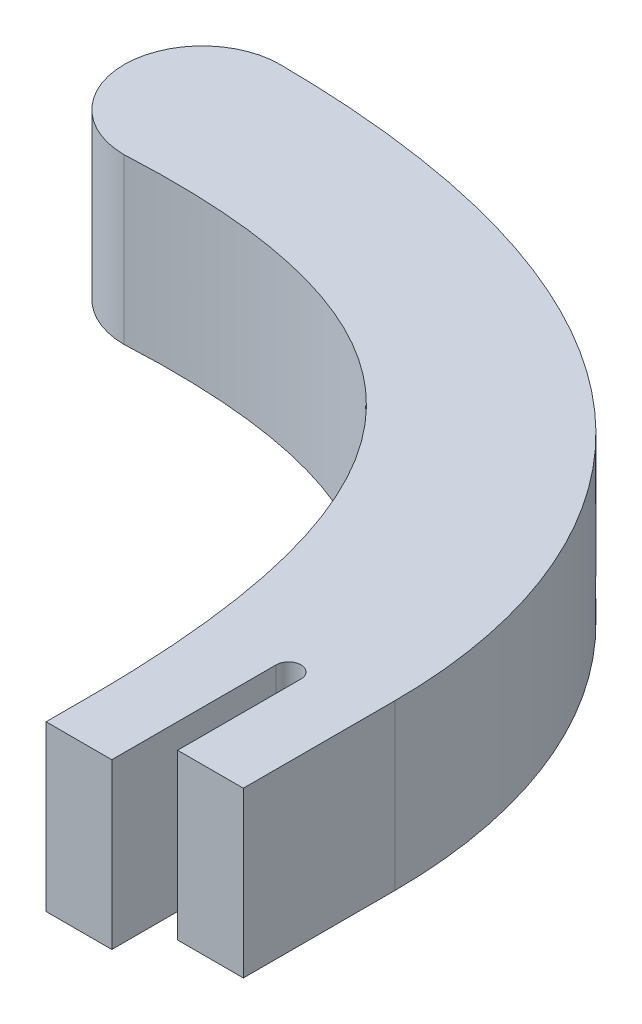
from build123d import *

# Parameters (mm, degrees)
SKETCH_1_R      = 8.1
EXTRUDE_1_DEPTH = 20
EXTRUDE_START   = -2
SKETCH_4_R      = 8.1
EXTRUDE_3_DEPTH = 2


with BuildPart() as part:
    # Sketch 1 → Extrude 1 (new body)
    with BuildSketch(Plane(origin=(0, 0, 0), x_dir=(1, 0, 0), z_dir=(0, 1, 0))):
        with BuildLine():
            Line((55, -69), (55, -74))
            Line((55, -74), (63, -74))
            Line((63, -74), (63, -54))
            ThreePointArc((63, -54), (64.501858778, -52.498141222), (66.003717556, -54))
            Line((66.003717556, -54), (66.003717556, -68.999300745))
            Line((66.003717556, -68.999300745), (74.003717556, -68.999300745))
            Line((74.003717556, -68.999300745), (74.003717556, -50.540204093))
            add(Edge.make_bspline(
                [(74.003717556, -50.540204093), (74.003717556, -23.617533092), (57.27947195, 9.076427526), (0, 9.5)],
                knots=[0, 0, 0, 0, 1, 1, 1, 1], degree=3))
            ThreePointArc((0, 9.5), (-9.5, 0), (0, -9.5))
            add(Edge.make_bspline(
                [(0, -9.5), (39.009847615, -7.488131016), (55, -25.52744893), (55, -69)],
                knots=[0, 0, 0, 0, 1, 1, 1, 1], degree=3))
        make_face()
        with Locations(Location((0, 0, 0), (0, 0, 270))):
            Circle(SKETCH_1_R, mode=Mode.SUBTRACT)
    extrude(amount=EXTRUDE_1_DEPTH)

    # Sketch 4 → Extrude 3 (add)
    with BuildSketch(Plane(origin=(0, 20, 0), x_dir=(1, 0, 0), z_dir=(0, 1, 0)).offset(EXTRUDE_START)):
        with Locations(Location((0, 0, 0), (0, 0, 270))):
            Circle(SKETCH_4_R)
    extrude(amount=EXTRUDE_3_DEPTH)


solid = part.part
